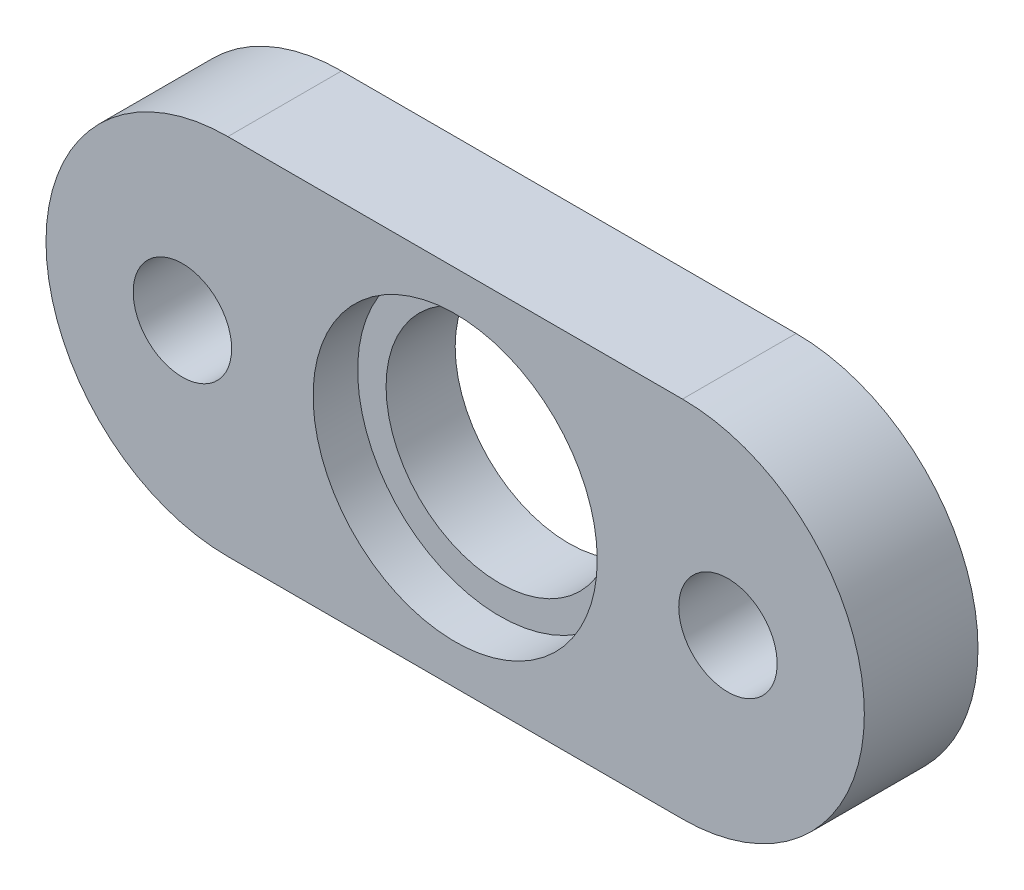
ISO-10303-21;
HEADER;
FILE_DESCRIPTION(('STEP AP214'),'2;1');
FILE_NAME('part.step','',(''),(''),'','','');
FILE_SCHEMA(('AUTOMOTIVE_DESIGN { 1 0 10303 214 1 1 1 1 }'));
ENDSEC;
DATA;
#1=APPLICATION_CONTEXT('core data for automotive mechanical design processes');
#2=APPLICATION_PROTOCOL_DEFINITION('international standard','automotive_design',2000,#1);
#3=PRODUCT_CONTEXT('',#1,'mechanical');
#4=PRODUCT('Part','Part','',(#3));
#5=PRODUCT_RELATED_PRODUCT_CATEGORY('part','',(#4));
#6=PRODUCT_DEFINITION_FORMATION('','',#4);
#7=PRODUCT_DEFINITION_CONTEXT('part definition',#1,'design');
#8=PRODUCT_DEFINITION('design','',#6,#7);
#9=PRODUCT_DEFINITION_SHAPE('','',#8);
#10=(LENGTH_UNIT() NAMED_UNIT(*) SI_UNIT(.MILLI.,.METRE.));
#11=(NAMED_UNIT(*) PLANE_ANGLE_UNIT() SI_UNIT($,.RADIAN.));
#12=(NAMED_UNIT(*) SI_UNIT($,.STERADIAN.) SOLID_ANGLE_UNIT());
#13=UNCERTAINTY_MEASURE_WITH_UNIT(LENGTH_MEASURE(1.E-05),#10,'distance_accuracy_value','');
#14=(GEOMETRIC_REPRESENTATION_CONTEXT(3) GLOBAL_UNCERTAINTY_ASSIGNED_CONTEXT((#13)) GLOBAL_UNIT_ASSIGNED_CONTEXT((#10,
#11,#12)) REPRESENTATION_CONTEXT('',''));
#15=CARTESIAN_POINT('',(0.,0.,0.));
#16=DIRECTION('',(0.,0.,1.));
#17=DIRECTION('',(1.,0.,0.));
#18=AXIS2_PLACEMENT_3D('',#15,#16,#17);
#19=CARTESIAN_POINT('',(-12.7,0.,6.35));
#20=DIRECTION('',(0.,0.,-1.));
#21=DIRECTION('',(-1.,0.,0.));
#22=AXIS2_PLACEMENT_3D('',#19,#20,#21);
#23=CYLINDRICAL_SURFACE('',#22,10.16);
#24=CARTESIAN_POINT('',(-12.7,0.,0.));
#25=DIRECTION('',(0.,0.,1.));
#26=DIRECTION('',(1.,0.,0.));
#27=AXIS2_PLACEMENT_3D('',#24,#25,#26);
#28=CIRCLE('',#27,10.16);
#29=CARTESIAN_POINT('',(-12.7,10.16,0.));
#30=VERTEX_POINT('',#29);
#31=CARTESIAN_POINT('',(-12.7,-10.16,0.));
#32=VERTEX_POINT('',#31);
#33=EDGE_CURVE('E102',#30,#32,#28,.T.);
#34=ORIENTED_EDGE('',*,*,#33,.T.);
#35=DIRECTION('',(0.,0.,-1.));
#36=VECTOR('',#35,1.);
#37=CARTESIAN_POINT('',(-12.7,-10.16,6.35));
#38=LINE('',#37,#36);
#39=CARTESIAN_POINT('',(-12.7,-10.16,6.35));
#40=VERTEX_POINT('',#39);
#41=EDGE_CURVE('E11',#40,#32,#38,.T.);
#42=ORIENTED_EDGE('',*,*,#41,.F.);
#43=CARTESIAN_POINT('',(-12.7,0.,6.35));
#44=DIRECTION('',(0.,0.,1.));
#45=DIRECTION('',(1.,0.,0.));
#46=AXIS2_PLACEMENT_3D('',#43,#44,#45);
#47=CIRCLE('',#46,10.16);
#48=CARTESIAN_POINT('',(-12.7,10.16,6.35));
#49=VERTEX_POINT('',#48);
#50=EDGE_CURVE('E89',#49,#40,#47,.T.);
#51=ORIENTED_EDGE('',*,*,#50,.F.);
#52=DIRECTION('',(0.,0.,-1.));
#53=VECTOR('',#52,1.);
#54=CARTESIAN_POINT('',(-12.7,10.16,6.35));
#55=LINE('',#54,#53);
#56=EDGE_CURVE('E98',#49,#30,#55,.T.);
#57=ORIENTED_EDGE('',*,*,#56,.T.);
#58=EDGE_LOOP('',(#34,#42,#51,#57));
#59=FACE_BOUND('',#58,.T.);
#60=ADVANCED_FACE('F37',(#59),#23,.T.);
#61=CARTESIAN_POINT('',(-12.7,-10.16,6.35));
#62=DIRECTION('',(0.,1.,0.));
#63=DIRECTION('',(-1.,0.,0.));
#64=AXIS2_PLACEMENT_3D('',#61,#62,#63);
#65=PLANE('',#64);
#66=DIRECTION('',(1.,0.,0.));
#67=VECTOR('',#66,1.);
#68=CARTESIAN_POINT('',(-12.7,-10.16,0.));
#69=LINE('',#68,#67);
#70=CARTESIAN_POINT('',(12.7,-10.16,0.));
#71=VERTEX_POINT('',#70);
#72=EDGE_CURVE('E93',#32,#71,#69,.T.);
#73=ORIENTED_EDGE('',*,*,#72,.T.);
#74=DIRECTION('',(0.,0.,-1.));
#75=VECTOR('',#74,1.);
#76=CARTESIAN_POINT('',(12.7,-10.16,6.35));
#77=LINE('',#76,#75);
#78=CARTESIAN_POINT('',(12.7,-10.16,6.35));
#79=VERTEX_POINT('',#78);
#80=EDGE_CURVE('E46',#79,#71,#77,.T.);
#81=ORIENTED_EDGE('',*,*,#80,.F.);
#82=DIRECTION('',(1.,0.,0.));
#83=VECTOR('',#82,1.);
#84=CARTESIAN_POINT('',(-12.7,-10.16,6.35));
#85=LINE('',#84,#83);
#86=EDGE_CURVE('E84',#40,#79,#85,.T.);
#87=ORIENTED_EDGE('',*,*,#86,.F.);
#88=ORIENTED_EDGE('',*,*,#41,.T.);
#89=EDGE_LOOP('',(#73,#81,#87,#88));
#90=FACE_BOUND('',#89,.T.);
#91=ADVANCED_FACE('F92',(#90),#65,.F.);
#92=CARTESIAN_POINT('',(12.7,0.,6.35));
#93=DIRECTION('',(0.,0.,-1.));
#94=DIRECTION('',(-1.,0.,0.));
#95=AXIS2_PLACEMENT_3D('',#92,#93,#94);
#96=CYLINDRICAL_SURFACE('',#95,10.16);
#97=CARTESIAN_POINT('',(12.7,0.,0.));
#98=DIRECTION('',(0.,0.,1.));
#99=DIRECTION('',(1.,0.,0.));
#100=AXIS2_PLACEMENT_3D('',#97,#98,#99);
#101=CIRCLE('',#100,10.16);
#102=CARTESIAN_POINT('',(12.7,10.16,0.));
#103=VERTEX_POINT('',#102);
#104=EDGE_CURVE('E71',#71,#103,#101,.T.);
#105=ORIENTED_EDGE('',*,*,#104,.T.);
#106=DIRECTION('',(0.,0.,-1.));
#107=VECTOR('',#106,1.);
#108=CARTESIAN_POINT('',(12.7,10.16,6.35));
#109=LINE('',#108,#107);
#110=CARTESIAN_POINT('',(12.7,10.16,6.35));
#111=VERTEX_POINT('',#110);
#112=EDGE_CURVE('E94',#111,#103,#109,.T.);
#113=ORIENTED_EDGE('',*,*,#112,.F.);
#114=CARTESIAN_POINT('',(12.7,0.,6.35));
#115=DIRECTION('',(0.,0.,1.));
#116=DIRECTION('',(1.,0.,0.));
#117=AXIS2_PLACEMENT_3D('',#114,#115,#116);
#118=CIRCLE('',#117,10.16);
#119=EDGE_CURVE('E87',#79,#111,#118,.T.);
#120=ORIENTED_EDGE('',*,*,#119,.F.);
#121=ORIENTED_EDGE('',*,*,#80,.T.);
#122=EDGE_LOOP('',(#105,#113,#120,#121));
#123=FACE_BOUND('',#122,.T.);
#124=ADVANCED_FACE('F96',(#123),#96,.T.);
#125=CARTESIAN_POINT('',(-12.7,10.16,6.35));
#126=DIRECTION('',(0.,-1.,0.));
#127=DIRECTION('',(1.,0.,0.));
#128=AXIS2_PLACEMENT_3D('',#125,#126,#127);
#129=PLANE('',#128);
#130=DIRECTION('',(-1.,0.,0.));
#131=VECTOR('',#130,1.);
#132=CARTESIAN_POINT('',(-12.7,10.16,0.));
#133=LINE('',#132,#131);
#134=EDGE_CURVE('E77',#103,#30,#133,.T.);
#135=ORIENTED_EDGE('',*,*,#134,.T.);
#136=ORIENTED_EDGE('',*,*,#56,.F.);
#137=DIRECTION('',(-1.,0.,0.));
#138=VECTOR('',#137,1.);
#139=CARTESIAN_POINT('',(-12.7,10.16,6.35));
#140=LINE('',#139,#138);
#141=EDGE_CURVE('E54',#111,#49,#140,.T.);
#142=ORIENTED_EDGE('',*,*,#141,.F.);
#143=ORIENTED_EDGE('',*,*,#112,.T.);
#144=EDGE_LOOP('',(#135,#136,#142,#143));
#145=FACE_BOUND('',#144,.T.);
#146=ADVANCED_FACE('F110',(#145),#129,.F.);
#147=CARTESIAN_POINT('',(-12.7,0.,6.35));
#148=DIRECTION('',(0.,0.,1.));
#149=DIRECTION('',(1.,0.,0.));
#150=AXIS2_PLACEMENT_3D('',#147,#148,#149);
#151=PLANE('',#150);
#152=CARTESIAN_POINT('',(15.24,0.,6.35));
#153=DIRECTION('',(0.,0.,1.));
#154=DIRECTION('',(-1.,0.,0.));
#155=AXIS2_PLACEMENT_3D('',#152,#153,#154);
#156=CIRCLE('',#155,2.75);
#157=CARTESIAN_POINT('',(12.49,0.,6.35));
#158=VERTEX_POINT('',#157);
#159=EDGE_CURVE('E125',#158,#158,#156,.T.);
#160=ORIENTED_EDGE('',*,*,#159,.F.);
#161=EDGE_LOOP('',(#160));
#162=FACE_BOUND('',#161,.T.);
#163=CARTESIAN_POINT('',(-15.24,0.,6.35));
#164=DIRECTION('',(0.,0.,1.));
#165=DIRECTION('',(1.,0.,0.));
#166=AXIS2_PLACEMENT_3D('',#163,#164,#165);
#167=CIRCLE('',#166,2.75);
#168=CARTESIAN_POINT('',(-12.49,0.,6.35));
#169=VERTEX_POINT('',#168);
#170=EDGE_CURVE('E131',#169,#169,#167,.T.);
#171=ORIENTED_EDGE('',*,*,#170,.F.);
#172=EDGE_LOOP('',(#171));
#173=FACE_BOUND('',#172,.T.);
#174=CARTESIAN_POINT('',(0.,0.,6.35));
#175=DIRECTION('',(0.,0.,1.));
#176=DIRECTION('',(1.,0.,0.));
#177=AXIS2_PLACEMENT_3D('',#174,#175,#176);
#178=CIRCLE('',#177,7.9375);
#179=CARTESIAN_POINT('',(7.9375,0.,6.35));
#180=VERTEX_POINT('',#179);
#181=EDGE_CURVE('E116',#180,#180,#178,.T.);
#182=ORIENTED_EDGE('',*,*,#181,.F.);
#183=EDGE_LOOP('',(#182));
#184=FACE_BOUND('',#183,.T.);
#185=ORIENTED_EDGE('',*,*,#50,.T.);
#186=ORIENTED_EDGE('',*,*,#86,.T.);
#187=ORIENTED_EDGE('',*,*,#119,.T.);
#188=ORIENTED_EDGE('',*,*,#141,.T.);
#189=EDGE_LOOP('',(#185,#186,#187,#188));
#190=FACE_BOUND('',#189,.T.);
#191=ADVANCED_FACE('F85',(#162,#173,#184,#190),#151,.T.);
#192=CARTESIAN_POINT('',(-12.7,0.,0.));
#193=DIRECTION('',(0.,0.,1.));
#194=DIRECTION('',(1.,0.,0.));
#195=AXIS2_PLACEMENT_3D('',#192,#193,#194);
#196=PLANE('',#195);
#197=CARTESIAN_POINT('',(15.24,0.,0.));
#198=DIRECTION('',(0.,0.,1.));
#199=DIRECTION('',(-1.,0.,0.));
#200=AXIS2_PLACEMENT_3D('',#197,#198,#199);
#201=CIRCLE('',#200,2.75);
#202=CARTESIAN_POINT('',(12.49,0.,0.));
#203=VERTEX_POINT('',#202);
#204=EDGE_CURVE('E128',#203,#203,#201,.T.);
#205=ORIENTED_EDGE('',*,*,#204,.T.);
#206=EDGE_LOOP('',(#205));
#207=FACE_BOUND('',#206,.T.);
#208=CARTESIAN_POINT('',(-15.24,0.,0.));
#209=DIRECTION('',(0.,0.,1.));
#210=DIRECTION('',(1.,0.,0.));
#211=AXIS2_PLACEMENT_3D('',#208,#209,#210);
#212=CIRCLE('',#211,2.75);
#213=CARTESIAN_POINT('',(-12.49,0.,0.));
#214=VERTEX_POINT('',#213);
#215=EDGE_CURVE('E124',#214,#214,#212,.T.);
#216=ORIENTED_EDGE('',*,*,#215,.T.);
#217=EDGE_LOOP('',(#216));
#218=FACE_BOUND('',#217,.T.);
#219=CARTESIAN_POINT('',(0.,0.,0.));
#220=DIRECTION('',(0.,0.,1.));
#221=DIRECTION('',(1.,0.,0.));
#222=AXIS2_PLACEMENT_3D('',#219,#220,#221);
#223=CIRCLE('',#222,6.35);
#224=CARTESIAN_POINT('',(6.35,0.,0.));
#225=VERTEX_POINT('',#224);
#226=EDGE_CURVE('E121',#225,#225,#223,.T.);
#227=ORIENTED_EDGE('',*,*,#226,.T.);
#228=EDGE_LOOP('',(#227));
#229=FACE_BOUND('',#228,.T.);
#230=ORIENTED_EDGE('',*,*,#33,.F.);
#231=ORIENTED_EDGE('',*,*,#134,.F.);
#232=ORIENTED_EDGE('',*,*,#104,.F.);
#233=ORIENTED_EDGE('',*,*,#72,.F.);
#234=EDGE_LOOP('',(#230,#231,#232,#233));
#235=FACE_BOUND('',#234,.T.);
#236=ADVANCED_FACE('F113',(#207,#218,#229,#235),#196,.F.);
#237=CARTESIAN_POINT('',(0.,0.,3.8608));
#238=DIRECTION('',(0.,0.,1.));
#239=DIRECTION('',(1.,0.,0.));
#240=AXIS2_PLACEMENT_3D('',#237,#238,#239);
#241=CYLINDRICAL_SURFACE('',#240,7.9375);
#242=CARTESIAN_POINT('',(0.,0.,3.8608));
#243=DIRECTION('',(0.,0.,1.));
#244=DIRECTION('',(1.,0.,0.));
#245=AXIS2_PLACEMENT_3D('',#242,#243,#244);
#246=CIRCLE('',#245,7.9375);
#247=CARTESIAN_POINT('',(7.9375,0.,3.8608));
#248=VERTEX_POINT('',#247);
#249=EDGE_CURVE('E105',#248,#248,#246,.T.);
#250=ORIENTED_EDGE('',*,*,#249,.F.);
#251=EDGE_LOOP('',(#250));
#252=FACE_BOUND('',#251,.T.);
#253=ORIENTED_EDGE('',*,*,#181,.T.);
#254=EDGE_LOOP('',(#253));
#255=FACE_BOUND('',#254,.T.);
#256=ADVANCED_FACE('F153',(#252,#255),#241,.F.);
#257=CARTESIAN_POINT('',(0.,0.,3.8608));
#258=DIRECTION('',(0.,0.,1.));
#259=DIRECTION('',(1.,0.,0.));
#260=AXIS2_PLACEMENT_3D('',#257,#258,#259);
#261=PLANE('',#260);
#262=CARTESIAN_POINT('',(0.,0.,3.8608));
#263=DIRECTION('',(0.,0.,1.));
#264=DIRECTION('',(1.,0.,0.));
#265=AXIS2_PLACEMENT_3D('',#262,#263,#264);
#266=CIRCLE('',#265,6.35);
#267=CARTESIAN_POINT('',(6.35,0.,3.8608));
#268=VERTEX_POINT('',#267);
#269=EDGE_CURVE('E40',#268,#268,#266,.T.);
#270=ORIENTED_EDGE('',*,*,#269,.F.);
#271=EDGE_LOOP('',(#270));
#272=FACE_BOUND('',#271,.T.);
#273=ORIENTED_EDGE('',*,*,#249,.T.);
#274=EDGE_LOOP('',(#273));
#275=FACE_BOUND('',#274,.T.);
#276=ADVANCED_FACE('F155',(#272,#275),#261,.T.);
#277=CARTESIAN_POINT('',(0.,0.,0.));
#278=DIRECTION('',(0.,0.,1.));
#279=DIRECTION('',(1.,0.,0.));
#280=AXIS2_PLACEMENT_3D('',#277,#278,#279);
#281=CYLINDRICAL_SURFACE('',#280,6.35);
#282=ORIENTED_EDGE('',*,*,#269,.T.);
#283=EDGE_LOOP('',(#282));
#284=FACE_BOUND('',#283,.T.);
#285=ORIENTED_EDGE('',*,*,#226,.F.);
#286=EDGE_LOOP('',(#285));
#287=FACE_BOUND('',#286,.T.);
#288=ADVANCED_FACE('F143',(#284,#287),#281,.F.);
#289=CARTESIAN_POINT('',(-15.24,0.,0.));
#290=DIRECTION('',(0.,0.,1.));
#291=DIRECTION('',(1.,0.,0.));
#292=AXIS2_PLACEMENT_3D('',#289,#290,#291);
#293=CYLINDRICAL_SURFACE('',#292,2.75);
#294=ORIENTED_EDGE('',*,*,#215,.F.);
#295=EDGE_LOOP('',(#294));
#296=FACE_BOUND('',#295,.T.);
#297=ORIENTED_EDGE('',*,*,#170,.T.);
#298=EDGE_LOOP('',(#297));
#299=FACE_BOUND('',#298,.T.);
#300=ADVANCED_FACE('F139',(#296,#299),#293,.F.);
#301=CARTESIAN_POINT('',(15.24,0.,0.));
#302=DIRECTION('',(0.,0.,1.));
#303=DIRECTION('',(1.,0.,0.));
#304=AXIS2_PLACEMENT_3D('',#301,#302,#303);
#305=CYLINDRICAL_SURFACE('',#304,2.75);
#306=ORIENTED_EDGE('',*,*,#204,.F.);
#307=EDGE_LOOP('',(#306));
#308=FACE_BOUND('',#307,.T.);
#309=ORIENTED_EDGE('',*,*,#159,.T.);
#310=EDGE_LOOP('',(#309));
#311=FACE_BOUND('',#310,.T.);
#312=ADVANCED_FACE('F142',(#308,#311),#305,.F.);
#313=CLOSED_SHELL('',(#60,#91,#124,#146,#191,#236,#256,#276,#288,#300,#312));
#314=MANIFOLD_SOLID_BREP('B2',#313);
#315=ADVANCED_BREP_SHAPE_REPRESENTATION('',(#18,#314),#14);
#316=SHAPE_DEFINITION_REPRESENTATION(#9,#315);
ENDSEC;
END-ISO-10303-21;
